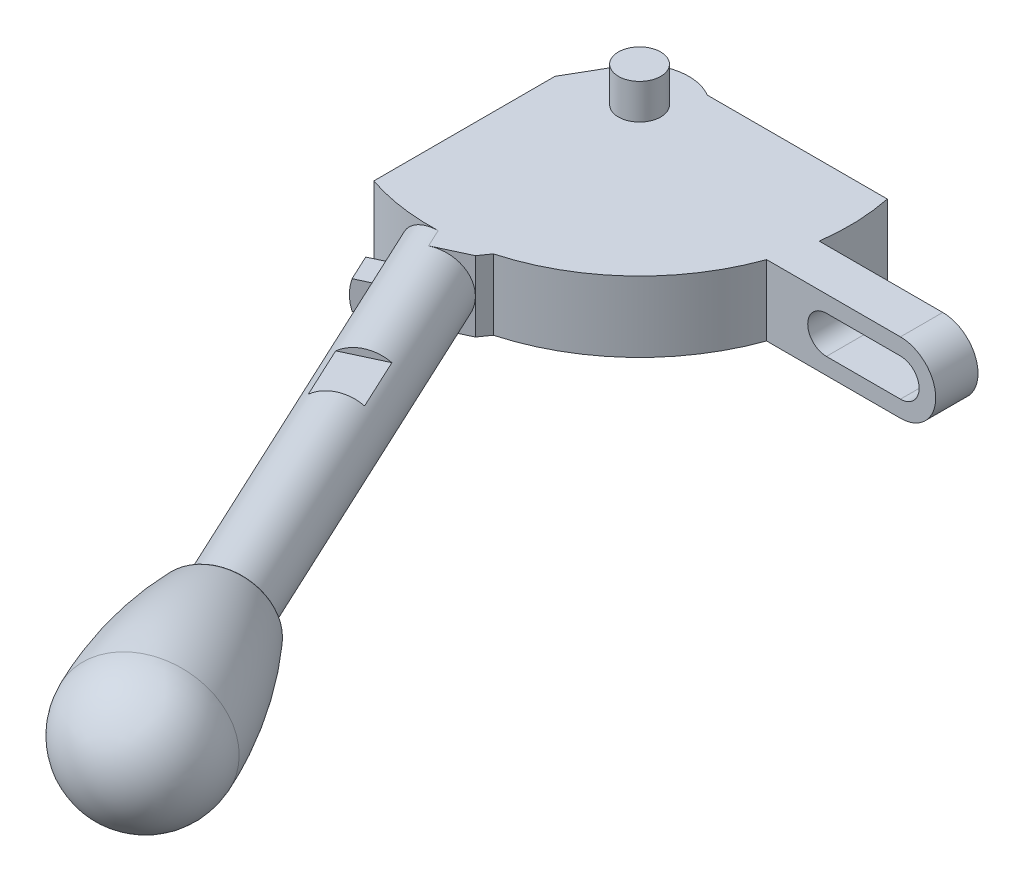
ISO-10303-21;
HEADER;
FILE_DESCRIPTION(('STEP AP214'),'2;1');
FILE_NAME('part.step','',(''),(''),'','','');
FILE_SCHEMA(('AUTOMOTIVE_DESIGN { 1 0 10303 214 1 1 1 1 }'));
ENDSEC;
DATA;
#1=APPLICATION_CONTEXT('core data for automotive mechanical design processes');
#2=APPLICATION_PROTOCOL_DEFINITION('international standard','automotive_design',2000,#1);
#3=PRODUCT_CONTEXT('',#1,'mechanical');
#4=PRODUCT('Part','Part','',(#3));
#5=PRODUCT_RELATED_PRODUCT_CATEGORY('part','',(#4));
#6=PRODUCT_DEFINITION_FORMATION('','',#4);
#7=PRODUCT_DEFINITION_CONTEXT('part definition',#1,'design');
#8=PRODUCT_DEFINITION('design','',#6,#7);
#9=PRODUCT_DEFINITION_SHAPE('','',#8);
#10=(LENGTH_UNIT() NAMED_UNIT(*) SI_UNIT(.MILLI.,.METRE.));
#11=(NAMED_UNIT(*) PLANE_ANGLE_UNIT() SI_UNIT($,.RADIAN.));
#12=(NAMED_UNIT(*) SI_UNIT($,.STERADIAN.) SOLID_ANGLE_UNIT());
#13=UNCERTAINTY_MEASURE_WITH_UNIT(LENGTH_MEASURE(1.E-05),#10,'distance_accuracy_value','');
#14=(GEOMETRIC_REPRESENTATION_CONTEXT(3) GLOBAL_UNCERTAINTY_ASSIGNED_CONTEXT((#13)) GLOBAL_UNIT_ASSIGNED_CONTEXT((#10,
#11,#12)) REPRESENTATION_CONTEXT('',''));
#15=CARTESIAN_POINT('',(0.,0.,0.));
#16=DIRECTION('',(0.,0.,1.));
#17=DIRECTION('',(1.,0.,0.));
#18=AXIS2_PLACEMENT_3D('',#15,#16,#17);
#19=CARTESIAN_POINT('',(37.4332550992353,0.,107.502842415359));
#20=DIRECTION('',(0.90630778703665,0.,-0.4226182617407));
#21=DIRECTION('',(0.4226182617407,0.,0.90630778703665));
#22=AXIS2_PLACEMENT_3D('',#19,#20,#21);
#23=SPHERICAL_SURFACE('',#22,10.);
#24=CARTESIAN_POINT('',(37.4332550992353,0.,107.502842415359));
#25=DIRECTION('',(-0.4226182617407,0.,-0.90630778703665));
#26=DIRECTION('',(0.90630778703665,0.,-0.4226182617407));
#27=AXIS2_PLACEMENT_3D('',#24,#25,#26);
#28=SPHERICAL_SURFACE('',#27,10.);
#29=CARTESIAN_POINT('',(37.4332550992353,0.,107.502842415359));
#30=DIRECTION('',(-0.4226182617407,0.,-0.90630778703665));
#31=DIRECTION('',(0.90630778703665,0.,-0.4226182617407));
#32=AXIS2_PLACEMENT_3D('',#29,#30,#31);
#33=CIRCLE('',#32,10.);
#34=CARTESIAN_POINT('',(46.4963329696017,0.,103.276659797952));
#35=VERTEX_POINT('',#34);
#36=EDGE_CURVE('E766',#35,#35,#33,.T.);
#37=ORIENTED_EDGE('',*,*,#36,.F.);
#38=EDGE_LOOP('',(#37));
#39=FACE_BOUND('',#38,.T.);
#40=ADVANCED_FACE('F14',(#39),#28,.T.);
#41=CARTESIAN_POINT('',(37.1311645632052,0.,106.855007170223));
#42=DIRECTION('',(-0.4226182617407,0.,-0.90630778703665));
#43=DIRECTION('',(0.90630778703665,0.,-0.4226182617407));
#44=AXIS2_PLACEMENT_3D('',#41,#42,#43);
#45=DEGENERATE_TOROIDAL_SURFACE('',#44,59.9963502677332,70.,.F.);
#46=CARTESIAN_POINT('',(28.7094254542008,0.,88.7945293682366));
#47=DIRECTION('',(-0.4226182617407,0.,-0.90630778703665));
#48=DIRECTION('',(0.90630778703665,0.,-0.4226182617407));
#49=AXIS2_PLACEMENT_3D('',#46,#47,#48);
#50=CIRCLE('',#49,7.10725210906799);
#51=CARTESIAN_POINT('',(35.1507833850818,0.,85.7908748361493));
#52=VERTEX_POINT('',#51);
#53=EDGE_CURVE('E772',#52,#52,#50,.T.);
#54=ORIENTED_EDGE('',*,*,#53,.F.);
#55=EDGE_LOOP('',(#54));
#56=FACE_BOUND('',#55,.T.);
#57=ORIENTED_EDGE('',*,*,#36,.T.);
#58=EDGE_LOOP('',(#57));
#59=FACE_BOUND('',#58,.T.);
#60=ADVANCED_FACE('F429',(#56,#59),#45,.F.);
#61=CARTESIAN_POINT('',(28.7695807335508,0.,88.923532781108));
#62=DIRECTION('',(-0.4226182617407,0.,-0.90630778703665));
#63=DIRECTION('',(0.90630778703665,0.,-0.4226182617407));
#64=AXIS2_PLACEMENT_3D('',#61,#62,#63);
#65=TOROIDAL_SURFACE('',#64,6.62794066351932,0.50000000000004);
#66=CARTESIAN_POINT('',(28.5582716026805,0.,88.4703788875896));
#67=DIRECTION('',(-0.4226182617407,0.,-0.90630778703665));
#68=DIRECTION('',(0.90630778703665,0.,-0.4226182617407));
#69=AXIS2_PLACEMENT_3D('',#66,#67,#68);
#70=CIRCLE('',#69,6.62794066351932);
#71=CARTESIAN_POINT('',(34.5652258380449,0.,85.6692901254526));
#72=VERTEX_POINT('',#71);
#73=EDGE_CURVE('E208',#72,#72,#70,.T.);
#74=ORIENTED_EDGE('',*,*,#73,.F.);
#75=EDGE_LOOP('',(#74));
#76=FACE_BOUND('',#75,.T.);
#77=ORIENTED_EDGE('',*,*,#53,.T.);
#78=EDGE_LOOP('',(#77));
#79=FACE_BOUND('',#78,.T.);
#80=ADVANCED_FACE('F425',(#76,#79),#65,.T.);
#81=CARTESIAN_POINT('',(28.5582716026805,-6.62794066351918,88.4703788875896));
#82=DIRECTION('',(0.4226182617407,0.,0.90630778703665));
#83=DIRECTION('',(-0.90630778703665,0.,0.4226182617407));
#84=AXIS2_PLACEMENT_3D('',#81,#82,#83);
#85=PLANE('',#84);
#86=ORIENTED_EDGE('',*,*,#73,.T.);
#87=EDGE_LOOP('',(#86));
#88=FACE_BOUND('',#87,.T.);
#89=CARTESIAN_POINT('',(28.5582716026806,0.,88.4703788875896));
#90=DIRECTION('',(-0.4226182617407,0.,-0.90630778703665));
#91=DIRECTION('',(-0.90630778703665,0.,0.4226182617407));
#92=AXIS2_PLACEMENT_3D('',#89,#90,#91);
#93=CIRCLE('',#92,5.);
#94=CARTESIAN_POINT('',(24.0267326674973,0.,90.5834701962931));
#95=VERTEX_POINT('',#94);
#96=EDGE_CURVE('E203',#95,#95,#93,.T.);
#97=ORIENTED_EDGE('',*,*,#96,.F.);
#98=EDGE_LOOP('',(#97));
#99=FACE_BOUND('',#98,.T.);
#100=ADVANCED_FACE('F421',(#88,#99),#85,.F.);
#101=CARTESIAN_POINT('',(14.9172252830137,7.,47.3860527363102));
#102=DIRECTION('',(-0.4226182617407,0.,-0.90630778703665));
#103=DIRECTION('',(-0.90630778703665,0.,0.4226182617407));
#104=AXIS2_PLACEMENT_3D('',#101,#102,#103);
#105=PLANE('',#104);
#106=DIRECTION('',(-0.90630778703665,0.,0.4226182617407));
#107=VECTOR('',#106,1.);
#108=CARTESIAN_POINT('',(14.9172252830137,4.,47.3860527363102));
#109=LINE('',#108,#107);
#110=CARTESIAN_POINT('',(13.1046097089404,4.,48.2312892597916));
#111=VERTEX_POINT('',#110);
#112=CARTESIAN_POINT('',(7.66676298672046,4.,50.7669988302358));
#113=VERTEX_POINT('',#112);
#114=EDGE_CURVE('E191',#111,#113,#109,.T.);
#115=ORIENTED_EDGE('',*,*,#114,.F.);
#116=CARTESIAN_POINT('',(10.3856863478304,0.,49.4991440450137));
#117=DIRECTION('',(-0.4226182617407,0.,-0.90630778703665));
#118=DIRECTION('',(-0.90630778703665,0.,0.4226182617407));
#119=AXIS2_PLACEMENT_3D('',#116,#117,#118);
#120=CIRCLE('',#119,5.);
#121=EDGE_CURVE('E196',#113,#111,#120,.T.);
#122=ORIENTED_EDGE('',*,*,#121,.F.);
#123=EDGE_LOOP('',(#115,#122));
#124=FACE_BOUND('',#123,.T.);
#125=ADVANCED_FACE('F424',(#124),#105,.F.);
#126=CARTESIAN_POINT('',(14.9172252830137,4.,47.3860527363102));
#127=DIRECTION('',(0.,-1.,0.));
#128=DIRECTION('',(0.4226182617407,0.,0.90630778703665));
#129=AXIS2_PLACEMENT_3D('',#126,#127,#128);
#130=PLANE('',#129);
#131=DIRECTION('',(-0.90630778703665,0.,0.4226182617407));
#132=VECTOR('',#131,1.);
#133=CARTESIAN_POINT('',(18.2981713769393,4.,54.6365150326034));
#134=LINE('',#133,#132);
#135=CARTESIAN_POINT('',(16.4855558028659,4.,55.4817515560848));
#136=VERTEX_POINT('',#135);
#137=CARTESIAN_POINT('',(11.0477090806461,4.,58.017461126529));
#138=VERTEX_POINT('',#137);
#139=EDGE_CURVE('E184',#136,#138,#134,.T.);
#140=ORIENTED_EDGE('',*,*,#139,.F.);
#141=DIRECTION('',(-0.4226182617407,0.,-0.90630778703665));
#142=VECTOR('',#141,1.);
#143=CARTESIAN_POINT('',(6.76533578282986,4.,34.6366724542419));
#144=LINE('',#143,#142);
#145=EDGE_CURVE('E176',#111,#136,#144,.F.);
#146=ORIENTED_EDGE('',*,*,#145,.F.);
#147=ORIENTED_EDGE('',*,*,#114,.T.);
#148=DIRECTION('',(-0.4226182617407,0.,-0.90630778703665));
#149=VECTOR('',#148,1.);
#150=CARTESIAN_POINT('',(1.32748906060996,4.,37.1723820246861));
#151=LINE('',#150,#149);
#152=EDGE_CURVE('E188',#138,#113,#151,.T.);
#153=ORIENTED_EDGE('',*,*,#152,.F.);
#154=EDGE_LOOP('',(#140,#146,#147,#153));
#155=FACE_BOUND('',#154,.T.);
#156=ADVANCED_FACE('F186',(#155),#130,.F.);
#157=CARTESIAN_POINT('',(18.2981713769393,7.,54.6365150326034));
#158=DIRECTION('',(0.4226182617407,0.,0.90630778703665));
#159=DIRECTION('',(0.90630778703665,0.,-0.4226182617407));
#160=AXIS2_PLACEMENT_3D('',#157,#158,#159);
#161=PLANE('',#160);
#162=ORIENTED_EDGE('',*,*,#139,.T.);
#163=CARTESIAN_POINT('',(13.766632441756,0.,56.7496063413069));
#164=DIRECTION('',(0.4226182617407,0.,0.90630778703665));
#165=DIRECTION('',(0.90630778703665,0.,-0.4226182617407));
#166=AXIS2_PLACEMENT_3D('',#163,#164,#165);
#167=CIRCLE('',#166,5.);
#168=EDGE_CURVE('E193',#136,#138,#167,.T.);
#169=ORIENTED_EDGE('',*,*,#168,.F.);
#170=EDGE_LOOP('',(#162,#169));
#171=FACE_BOUND('',#170,.T.);
#172=ADVANCED_FACE('F194',(#171),#161,.F.);
#173=CARTESIAN_POINT('',(4.0464124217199,0.,35.9045272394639));
#174=DIRECTION('',(0.4226182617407,0.,0.906307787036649));
#175=DIRECTION('',(0.906307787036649,0.,-0.4226182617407));
#176=AXIS2_PLACEMENT_3D('',#173,#174,#175);
#177=PLANE('',#176);
#178=DIRECTION('',(0.906307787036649,0.,-0.422618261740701));
#179=VECTOR('',#178,1.);
#180=CARTESIAN_POINT('',(-0.106811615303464,-2.,37.8412074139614));
#181=LINE('',#180,#179);
#182=CARTESIAN_POINT('',(-2.03328503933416,-2.,38.739536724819));
#183=VERTEX_POINT('',#182);
#184=CARTESIAN_POINT('',(-0.106811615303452,-2.,37.8412074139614));
#185=VERTEX_POINT('',#184);
#186=EDGE_CURVE('E252',#183,#185,#181,.T.);
#187=ORIENTED_EDGE('',*,*,#186,.T.);
#188=CARTESIAN_POINT('',(4.04641242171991,0.,35.904527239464));
#189=DIRECTION('',(-0.4226182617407,0.,-0.90630778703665));
#190=DIRECTION('',(-0.90630778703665,0.,0.4226182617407));
#191=AXIS2_PLACEMENT_3D('',#188,#189,#190);
#192=CIRCLE('',#191,5.);
#193=CARTESIAN_POINT('',(-0.106811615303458,2.,37.8412074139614));
#194=VERTEX_POINT('',#193);
#195=EDGE_CURVE('E34',#185,#194,#192,.T.);
#196=ORIENTED_EDGE('',*,*,#195,.T.);
#197=DIRECTION('',(-0.906307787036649,0.,0.422618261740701));
#198=VECTOR('',#197,1.);
#199=CARTESIAN_POINT('',(-0.106811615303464,2.,37.8412074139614));
#200=LINE('',#199,#198);
#201=CARTESIAN_POINT('',(-2.03328503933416,2.,38.739536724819));
#202=VERTEX_POINT('',#201);
#203=EDGE_CURVE('E268',#194,#202,#200,.T.);
#204=ORIENTED_EDGE('',*,*,#203,.T.);
#205=CARTESIAN_POINT('',(4.0464124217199,0.,35.9045272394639));
#206=DIRECTION('',(0.4226182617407,0.,0.906307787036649));
#207=DIRECTION('',(0.906307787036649,0.,-0.4226182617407));
#208=AXIS2_PLACEMENT_3D('',#205,#206,#207);
#209=CIRCLE('',#208,7.);
#210=EDGE_CURVE('E249',#202,#183,#209,.T.);
#211=ORIENTED_EDGE('',*,*,#210,.T.);
#212=EDGE_LOOP('',(#187,#196,#204,#211));
#213=FACE_BOUND('',#212,.T.);
#214=ADVANCED_FACE('F439',(#213),#177,.T.);
#215=CARTESIAN_POINT('',(4.0464124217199,0.,35.9045272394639));
#216=DIRECTION('',(-0.4226182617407,0.,-0.906307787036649));
#217=DIRECTION('',(-0.906307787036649,0.,0.4226182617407));
#218=AXIS2_PLACEMENT_3D('',#215,#216,#217);
#219=CYLINDRICAL_SURFACE('',#218,7.);
#220=CARTESIAN_POINT('',(2.3559393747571,0.,32.2792960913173));
#221=DIRECTION('',(0.4226182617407,0.,0.906307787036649));
#222=DIRECTION('',(0.906307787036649,0.,-0.4226182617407));
#223=AXIS2_PLACEMENT_3D('',#220,#221,#222);
#224=CIRCLE('',#223,7.);
#225=CARTESIAN_POINT('',(-3.72375808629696,2.,35.1143055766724));
#226=VERTEX_POINT('',#225);
#227=CARTESIAN_POINT('',(-3.72375808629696,-2.,35.1143055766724));
#228=VERTEX_POINT('',#227);
#229=EDGE_CURVE('E248',#226,#228,#224,.T.);
#230=ORIENTED_EDGE('',*,*,#229,.T.);
#231=DIRECTION('',(-0.4226182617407,0.,-0.906307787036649));
#232=VECTOR('',#231,1.);
#233=CARTESIAN_POINT('',(-2.03328503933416,-2.,38.739536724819));
#234=LINE('',#233,#232);
#235=EDGE_CURVE('E269',#183,#228,#234,.T.);
#236=ORIENTED_EDGE('',*,*,#235,.F.);
#237=ORIENTED_EDGE('',*,*,#210,.F.);
#238=DIRECTION('',(-0.4226182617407,0.,-0.906307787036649));
#239=VECTOR('',#238,1.);
#240=CARTESIAN_POINT('',(-2.03328503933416,2.,38.739536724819));
#241=LINE('',#240,#239);
#242=EDGE_CURVE('E264',#202,#226,#241,.T.);
#243=ORIENTED_EDGE('',*,*,#242,.T.);
#244=EDGE_LOOP('',(#230,#236,#237,#243));
#245=FACE_BOUND('',#244,.T.);
#246=ADVANCED_FACE('F466',(#245),#219,.T.);
#247=CARTESIAN_POINT('',(-0.106811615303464,-2.,37.8412074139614));
#248=DIRECTION('',(0.,1.,0.));
#249=DIRECTION('',(1.,0.,0.));
#250=AXIS2_PLACEMENT_3D('',#247,#248,#249);
#251=PLANE('',#250);
#252=DIRECTION('',(0.906307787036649,0.,-0.422618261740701));
#253=VECTOR('',#252,1.);
#254=CARTESIAN_POINT('',(-1.79728466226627,-2.,34.2159762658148));
#255=LINE('',#254,#253);
#256=CARTESIAN_POINT('',(-1.79728466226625,-2.,34.2159762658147));
#257=VERTEX_POINT('',#256);
#258=EDGE_CURVE('E256',#228,#257,#255,.T.);
#259=ORIENTED_EDGE('',*,*,#258,.T.);
#260=DIRECTION('',(-0.4226182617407,0.,-0.906307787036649));
#261=VECTOR('',#260,1.);
#262=CARTESIAN_POINT('',(-0.106811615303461,-2.,37.8412074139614));
#263=LINE('',#262,#261);
#264=EDGE_CURVE('E273',#185,#257,#263,.T.);
#265=ORIENTED_EDGE('',*,*,#264,.F.);
#266=ORIENTED_EDGE('',*,*,#186,.F.);
#267=ORIENTED_EDGE('',*,*,#235,.T.);
#268=EDGE_LOOP('',(#259,#265,#266,#267));
#269=FACE_BOUND('',#268,.T.);
#270=ADVANCED_FACE('F474',(#269),#251,.F.);
#271=CARTESIAN_POINT('',(-0.106811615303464,2.,37.8412074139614));
#272=DIRECTION('',(0.,-1.,0.));
#273=DIRECTION('',(-1.,0.,0.));
#274=AXIS2_PLACEMENT_3D('',#271,#272,#273);
#275=PLANE('',#274);
#276=DIRECTION('',(-0.906307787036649,0.,0.422618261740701));
#277=VECTOR('',#276,1.);
#278=CARTESIAN_POINT('',(-1.79728466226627,2.,34.2159762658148));
#279=LINE('',#278,#277);
#280=CARTESIAN_POINT('',(-1.79728466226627,2.,34.2159762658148));
#281=VERTEX_POINT('',#280);
#282=EDGE_CURVE('E253',#281,#226,#279,.T.);
#283=ORIENTED_EDGE('',*,*,#282,.T.);
#284=ORIENTED_EDGE('',*,*,#242,.F.);
#285=ORIENTED_EDGE('',*,*,#203,.F.);
#286=DIRECTION('',(-0.4226182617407,0.,-0.906307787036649));
#287=VECTOR('',#286,1.);
#288=CARTESIAN_POINT('',(-0.106811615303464,2.,37.8412074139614));
#289=LINE('',#288,#287);
#290=EDGE_CURVE('E267',#194,#281,#289,.T.);
#291=ORIENTED_EDGE('',*,*,#290,.T.);
#292=EDGE_LOOP('',(#283,#284,#285,#291));
#293=FACE_BOUND('',#292,.T.);
#294=ADVANCED_FACE('F470',(#293),#275,.F.);
#295=CARTESIAN_POINT('',(2.3559393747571,0.,32.2792960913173));
#296=DIRECTION('',(0.4226182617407,0.,0.906307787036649));
#297=DIRECTION('',(0.906307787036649,0.,-0.4226182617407));
#298=AXIS2_PLACEMENT_3D('',#295,#296,#297);
#299=PLANE('',#298);
#300=ORIENTED_EDGE('',*,*,#282,.F.);
#301=CARTESIAN_POINT('',(2.35593937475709,0.,32.2792960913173));
#302=DIRECTION('',(-0.4226182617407,0.,-0.906307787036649));
#303=DIRECTION('',(-0.906307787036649,0.,0.4226182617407));
#304=AXIS2_PLACEMENT_3D('',#301,#302,#303);
#305=CIRCLE('',#304,5.);
#306=EDGE_CURVE('E362',#281,#257,#305,.F.);
#307=ORIENTED_EDGE('',*,*,#306,.T.);
#308=ORIENTED_EDGE('',*,*,#258,.F.);
#309=ORIENTED_EDGE('',*,*,#229,.F.);
#310=EDGE_LOOP('',(#300,#307,#308,#309));
#311=FACE_BOUND('',#310,.T.);
#312=ADVANCED_FACE('F456',(#311),#299,.F.);
#313=CARTESIAN_POINT('',(36.5,0.,12.));
#314=DIRECTION('',(0.,0.,-1.));
#315=DIRECTION('',(0.,1.,0.));
#316=AXIS2_PLACEMENT_3D('',#313,#314,#315);
#317=CYLINDRICAL_SURFACE('',#316,2.65);
#318=DIRECTION('',(0.,0.,-1.));
#319=VECTOR('',#318,1.);
#320=CARTESIAN_POINT('',(36.5,-2.65,12.));
#321=LINE('',#320,#319);
#322=CARTESIAN_POINT('',(36.5,-2.65,10.));
#323=VERTEX_POINT('',#322);
#324=CARTESIAN_POINT('',(36.5,-2.65,4.));
#325=VERTEX_POINT('',#324);
#326=EDGE_CURVE('E167',#323,#325,#321,.T.);
#327=ORIENTED_EDGE('',*,*,#326,.T.);
#328=CARTESIAN_POINT('',(36.5,0.,4.));
#329=DIRECTION('',(0.,0.,-1.));
#330=DIRECTION('',(0.,1.,0.));
#331=AXIS2_PLACEMENT_3D('',#328,#329,#330);
#332=CIRCLE('',#331,2.65);
#333=CARTESIAN_POINT('',(36.5,2.65,4.));
#334=VERTEX_POINT('',#333);
#335=EDGE_CURVE('E223',#325,#334,#332,.T.);
#336=ORIENTED_EDGE('',*,*,#335,.T.);
#337=DIRECTION('',(0.,0.,-1.));
#338=VECTOR('',#337,1.);
#339=CARTESIAN_POINT('',(36.5,2.65,12.));
#340=LINE('',#339,#338);
#341=CARTESIAN_POINT('',(36.5,2.65,10.));
#342=VERTEX_POINT('',#341);
#343=EDGE_CURVE('E233',#342,#334,#340,.T.);
#344=ORIENTED_EDGE('',*,*,#343,.F.);
#345=CARTESIAN_POINT('',(36.5,0.,10.));
#346=DIRECTION('',(0.,0.,-1.));
#347=DIRECTION('',(0.,1.,0.));
#348=AXIS2_PLACEMENT_3D('',#345,#346,#347);
#349=CIRCLE('',#348,2.65);
#350=EDGE_CURVE('E239',#323,#342,#349,.T.);
#351=ORIENTED_EDGE('',*,*,#350,.F.);
#352=EDGE_LOOP('',(#327,#336,#344,#351));
#353=FACE_BOUND('',#352,.T.);
#354=ADVANCED_FACE('F452',(#353),#317,.F.);
#355=CARTESIAN_POINT('',(47.,2.65,12.));
#356=DIRECTION('',(0.,1.,0.));
#357=DIRECTION('',(1.,0.,0.));
#358=AXIS2_PLACEMENT_3D('',#355,#356,#357);
#359=PLANE('',#358);
#360=ORIENTED_EDGE('',*,*,#343,.T.);
#361=DIRECTION('',(1.,0.,0.));
#362=VECTOR('',#361,1.);
#363=CARTESIAN_POINT('',(47.,2.65,4.));
#364=LINE('',#363,#362);
#365=CARTESIAN_POINT('',(47.,2.65,4.));
#366=VERTEX_POINT('',#365);
#367=EDGE_CURVE('E226',#334,#366,#364,.T.);
#368=ORIENTED_EDGE('',*,*,#367,.T.);
#369=DIRECTION('',(0.,0.,-1.));
#370=VECTOR('',#369,1.);
#371=CARTESIAN_POINT('',(47.,2.65,12.));
#372=LINE('',#371,#370);
#373=CARTESIAN_POINT('',(47.,2.65,10.));
#374=VERTEX_POINT('',#373);
#375=EDGE_CURVE('E230',#374,#366,#372,.T.);
#376=ORIENTED_EDGE('',*,*,#375,.F.);
#377=DIRECTION('',(1.,0.,0.));
#378=VECTOR('',#377,1.);
#379=CARTESIAN_POINT('',(52.,2.65,10.));
#380=LINE('',#379,#378);
#381=EDGE_CURVE('E242',#342,#374,#380,.T.);
#382=ORIENTED_EDGE('',*,*,#381,.F.);
#383=EDGE_LOOP('',(#360,#368,#376,#382));
#384=FACE_BOUND('',#383,.T.);
#385=ADVANCED_FACE('F448',(#384),#359,.F.);
#386=CARTESIAN_POINT('',(47.,0.,12.));
#387=DIRECTION('',(0.,0.,-1.));
#388=DIRECTION('',(0.,1.,0.));
#389=AXIS2_PLACEMENT_3D('',#386,#387,#388);
#390=CYLINDRICAL_SURFACE('',#389,2.65);
#391=ORIENTED_EDGE('',*,*,#375,.T.);
#392=CARTESIAN_POINT('',(47.,0.,4.));
#393=DIRECTION('',(0.,0.,-1.));
#394=DIRECTION('',(0.,1.,0.));
#395=AXIS2_PLACEMENT_3D('',#392,#393,#394);
#396=CIRCLE('',#395,2.65);
#397=CARTESIAN_POINT('',(47.,-2.65,4.));
#398=VERTEX_POINT('',#397);
#399=EDGE_CURVE('E161',#366,#398,#396,.T.);
#400=ORIENTED_EDGE('',*,*,#399,.T.);
#401=DIRECTION('',(0.,0.,-1.));
#402=VECTOR('',#401,1.);
#403=CARTESIAN_POINT('',(47.,-2.65,12.));
#404=LINE('',#403,#402);
#405=CARTESIAN_POINT('',(47.,-2.65,10.));
#406=VERTEX_POINT('',#405);
#407=EDGE_CURVE('E229',#406,#398,#404,.T.);
#408=ORIENTED_EDGE('',*,*,#407,.F.);
#409=CARTESIAN_POINT('',(47.,0.,10.));
#410=DIRECTION('',(0.,0.,-1.));
#411=DIRECTION('',(0.,1.,0.));
#412=AXIS2_PLACEMENT_3D('',#409,#410,#411);
#413=CIRCLE('',#412,2.65);
#414=EDGE_CURVE('E245',#374,#406,#413,.T.);
#415=ORIENTED_EDGE('',*,*,#414,.F.);
#416=EDGE_LOOP('',(#391,#400,#408,#415));
#417=FACE_BOUND('',#416,.T.);
#418=ADVANCED_FACE('F451',(#417),#390,.F.);
#419=CARTESIAN_POINT('',(47.,-2.65,12.));
#420=DIRECTION('',(0.,-1.,0.));
#421=DIRECTION('',(-1.,0.,0.));
#422=AXIS2_PLACEMENT_3D('',#419,#420,#421);
#423=PLANE('',#422);
#424=ORIENTED_EDGE('',*,*,#407,.T.);
#425=DIRECTION('',(-1.,0.,0.));
#426=VECTOR('',#425,1.);
#427=CARTESIAN_POINT('',(47.,-2.65,4.));
#428=LINE('',#427,#426);
#429=EDGE_CURVE('E221',#398,#325,#428,.T.);
#430=ORIENTED_EDGE('',*,*,#429,.T.);
#431=ORIENTED_EDGE('',*,*,#326,.F.);
#432=DIRECTION('',(-1.,0.,0.));
#433=VECTOR('',#432,1.);
#434=CARTESIAN_POINT('',(52.,-2.65,10.));
#435=LINE('',#434,#433);
#436=EDGE_CURVE('E232',#406,#323,#435,.T.);
#437=ORIENTED_EDGE('',*,*,#436,.F.);
#438=EDGE_LOOP('',(#424,#430,#431,#437));
#439=FACE_BOUND('',#438,.T.);
#440=ADVANCED_FACE('F458',(#439),#423,.F.);
#441=CARTESIAN_POINT('',(-2.17559956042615,-5.,34.3923874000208));
#442=DIRECTION('',(-0.4226182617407,0.,-0.906307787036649));
#443=DIRECTION('',(-0.906307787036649,0.,0.4226182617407));
#444=AXIS2_PLACEMENT_3D('',#441,#442,#443);
#445=PLANE('',#444);
#446=CARTESIAN_POINT('',(2.3559393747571,0.,32.2792960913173));
#447=DIRECTION('',(0.4226182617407,0.,0.906307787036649));
#448=DIRECTION('',(0.906307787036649,0.,-0.4226182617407));
#449=AXIS2_PLACEMENT_3D('',#446,#447,#448);
#450=CIRCLE('',#449,5.);
#451=CARTESIAN_POINT('',(6.88747830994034,0.,30.1662047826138));
#452=VERTEX_POINT('',#451);
#453=CARTESIAN_POINT('',(2.35593937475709,5.,32.2792960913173));
#454=VERTEX_POINT('',#453);
#455=EDGE_CURVE('E259',#452,#454,#450,.T.);
#456=ORIENTED_EDGE('',*,*,#455,.F.);
#457=DIRECTION('',(0.,1.,0.));
#458=VECTOR('',#457,1.);
#459=CARTESIAN_POINT('',(6.88747830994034,-5.,30.1662047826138));
#460=LINE('',#459,#458);
#461=CARTESIAN_POINT('',(6.88747830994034,5.,30.1662047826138));
#462=VERTEX_POINT('',#461);
#463=EDGE_CURVE('E346',#452,#462,#460,.T.);
#464=ORIENTED_EDGE('',*,*,#463,.T.);
#465=DIRECTION('',(-0.906307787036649,0.,0.4226182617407));
#466=VECTOR('',#465,1.);
#467=CARTESIAN_POINT('',(-2.17559956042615,5.,34.3923874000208));
#468=LINE('',#467,#466);
#469=EDGE_CURVE('E319',#462,#454,#468,.T.);
#470=ORIENTED_EDGE('',*,*,#469,.T.);
#471=EDGE_LOOP('',(#456,#464,#470));
#472=FACE_BOUND('',#471,.T.);
#473=ADVANCED_FACE('F461',(#472),#445,.F.);
#474=CARTESIAN_POINT('',(0.,-5.,0.));
#475=DIRECTION('',(0.,1.,0.));
#476=DIRECTION('',(0.,0.,1.));
#477=AXIS2_PLACEMENT_3D('',#474,#475,#476);
#478=CYLINDRICAL_SURFACE('',#477,29.75);
#479=CARTESIAN_POINT('',(0.,5.,0.));
#480=DIRECTION('',(0.,-1.,0.));
#481=DIRECTION('',(0.,0.,1.));
#482=AXIS2_PLACEMENT_3D('',#479,#480,#481);
#483=CIRCLE('',#482,29.75);
#484=CARTESIAN_POINT('',(29.138677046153,5.,-6.));
#485=VERTEX_POINT('',#484);
#486=CARTESIAN_POINT('',(29.4798660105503,5.,4.));
#487=VERTEX_POINT('',#486);
#488=EDGE_CURVE('E298',#485,#487,#483,.T.);
#489=ORIENTED_EDGE('',*,*,#488,.T.);
#490=DIRECTION('',(0.,1.,0.));
#491=VECTOR('',#490,1.);
#492=CARTESIAN_POINT('',(29.4798660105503,-5.,4.));
#493=LINE('',#492,#491);
#494=CARTESIAN_POINT('',(29.4798660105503,-5.,4.));
#495=VERTEX_POINT('',#494);
#496=EDGE_CURVE('E303',#495,#487,#493,.T.);
#497=ORIENTED_EDGE('',*,*,#496,.F.);
#498=CARTESIAN_POINT('',(0.,-5.,0.));
#499=DIRECTION('',(0.,-1.,0.));
#500=DIRECTION('',(0.,0.,1.));
#501=AXIS2_PLACEMENT_3D('',#498,#499,#500);
#502=CIRCLE('',#501,29.75);
#503=CARTESIAN_POINT('',(29.138677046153,-5.,-6.));
#504=VERTEX_POINT('',#503);
#505=EDGE_CURVE('E284',#504,#495,#502,.T.);
#506=ORIENTED_EDGE('',*,*,#505,.F.);
#507=DIRECTION('',(0.,1.,0.));
#508=VECTOR('',#507,1.);
#509=CARTESIAN_POINT('',(29.138677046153,-5.,-6.));
#510=LINE('',#509,#508);
#511=EDGE_CURVE('E306',#504,#485,#510,.T.);
#512=ORIENTED_EDGE('',*,*,#511,.T.);
#513=EDGE_LOOP('',(#489,#497,#506,#512));
#514=FACE_BOUND('',#513,.T.);
#515=ADVANCED_FACE('F482',(#514),#478,.T.);
#516=CARTESIAN_POINT('',(29.138677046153,-5.,-6.));
#517=DIRECTION('',(0.,0.,1.));
#518=DIRECTION('',(1.,0.,0.));
#519=AXIS2_PLACEMENT_3D('',#516,#517,#518);
#520=PLANE('',#519);
#521=DIRECTION('',(1.,0.,0.));
#522=VECTOR('',#521,1.);
#523=CARTESIAN_POINT('',(29.138677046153,5.,-6.));
#524=LINE('',#523,#522);
#525=CARTESIAN_POINT('',(3.605551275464,5.,-6.));
#526=VERTEX_POINT('',#525);
#527=EDGE_CURVE('E295',#526,#485,#524,.T.);
#528=ORIENTED_EDGE('',*,*,#527,.T.);
#529=ORIENTED_EDGE('',*,*,#511,.F.);
#530=DIRECTION('',(1.,0.,0.));
#531=VECTOR('',#530,1.);
#532=CARTESIAN_POINT('',(29.138677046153,-5.,-6.));
#533=LINE('',#532,#531);
#534=CARTESIAN_POINT('',(3.605551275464,-5.,-6.));
#535=VERTEX_POINT('',#534);
#536=EDGE_CURVE('E281',#535,#504,#533,.T.);
#537=ORIENTED_EDGE('',*,*,#536,.F.);
#538=DIRECTION('',(0.,1.,0.));
#539=VECTOR('',#538,1.);
#540=CARTESIAN_POINT('',(3.605551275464,-5.,-6.));
#541=LINE('',#540,#539);
#542=EDGE_CURVE('E308',#535,#526,#541,.T.);
#543=ORIENTED_EDGE('',*,*,#542,.T.);
#544=EDGE_LOOP('',(#528,#529,#537,#543));
#545=FACE_BOUND('',#544,.T.);
#546=ADVANCED_FACE('F485',(#545),#520,.F.);
#547=CARTESIAN_POINT('',(0.,-5.,0.));
#548=DIRECTION('',(0.,1.,0.));
#549=DIRECTION('',(0.,0.,1.));
#550=AXIS2_PLACEMENT_3D('',#547,#548,#549);
#551=CYLINDRICAL_SURFACE('',#550,7.);
#552=CARTESIAN_POINT('',(0.,5.,0.));
#553=DIRECTION('',(0.,-1.,0.));
#554=DIRECTION('',(0.,0.,1.));
#555=AXIS2_PLACEMENT_3D('',#552,#553,#554);
#556=CIRCLE('',#555,7.);
#557=CARTESIAN_POINT('',(-6.32447149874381,5.,-3.00017670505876));
#558=VERTEX_POINT('',#557);
#559=EDGE_CURVE('E293',#558,#526,#556,.T.);
#560=ORIENTED_EDGE('',*,*,#559,.T.);
#561=ORIENTED_EDGE('',*,*,#542,.F.);
#562=CARTESIAN_POINT('',(0.,-5.,0.));
#563=DIRECTION('',(0.,-1.,0.));
#564=DIRECTION('',(0.,0.,1.));
#565=AXIS2_PLACEMENT_3D('',#562,#563,#564);
#566=CIRCLE('',#565,7.);
#567=CARTESIAN_POINT('',(-6.32447149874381,-5.,-3.00017670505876));
#568=VERTEX_POINT('',#567);
#569=EDGE_CURVE('E277',#568,#535,#566,.T.);
#570=ORIENTED_EDGE('',*,*,#569,.F.);
#571=DIRECTION('',(0.,1.,0.));
#572=VECTOR('',#571,1.);
#573=CARTESIAN_POINT('',(-6.32447149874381,-5.,-3.00017670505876));
#574=LINE('',#573,#572);
#575=EDGE_CURVE('E311',#568,#558,#574,.T.);
#576=ORIENTED_EDGE('',*,*,#575,.T.);
#577=EDGE_LOOP('',(#560,#561,#570,#576));
#578=FACE_BOUND('',#577,.T.);
#579=ADVANCED_FACE('F489',(#578),#551,.T.);
#580=CARTESIAN_POINT('',(-9.5,-5.,2.5));
#581=DIRECTION('',(0.866025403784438,0.,0.5));
#582=DIRECTION('',(0.5,0.,-0.866025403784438));
#583=AXIS2_PLACEMENT_3D('',#580,#581,#582);
#584=PLANE('',#583);
#585=DIRECTION('',(0.5,0.,-0.866025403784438));
#586=VECTOR('',#585,1.);
#587=CARTESIAN_POINT('',(-9.5,5.,2.5));
#588=LINE('',#587,#586);
#589=CARTESIAN_POINT('',(-9.5,5.,2.5));
#590=VERTEX_POINT('',#589);
#591=EDGE_CURVE('E272',#590,#558,#588,.T.);
#592=ORIENTED_EDGE('',*,*,#591,.T.);
#593=ORIENTED_EDGE('',*,*,#575,.F.);
#594=DIRECTION('',(0.5,0.,-0.866025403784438));
#595=VECTOR('',#594,1.);
#596=CARTESIAN_POINT('',(-9.5,-5.,2.5));
#597=LINE('',#596,#595);
#598=CARTESIAN_POINT('',(-9.5,-5.,2.5));
#599=VERTEX_POINT('',#598);
#600=EDGE_CURVE('E274',#599,#568,#597,.T.);
#601=ORIENTED_EDGE('',*,*,#600,.F.);
#602=DIRECTION('',(0.,1.,0.));
#603=VECTOR('',#602,1.);
#604=CARTESIAN_POINT('',(-9.5,-5.,2.5));
#605=LINE('',#604,#603);
#606=EDGE_CURVE('E290',#599,#590,#605,.T.);
#607=ORIENTED_EDGE('',*,*,#606,.T.);
#608=EDGE_LOOP('',(#592,#593,#601,#607));
#609=FACE_BOUND('',#608,.T.);
#610=ADVANCED_FACE('F393',(#609),#584,.F.);
#611=CARTESIAN_POINT('',(-9.5,-5.,36.));
#612=DIRECTION('',(-1.,0.,0.));
#613=DIRECTION('',(0.,1.,0.));
#614=AXIS2_PLACEMENT_3D('',#611,#612,#613);
#615=PLANE('',#614);
#616=ORIENTED_EDGE('',*,*,#606,.F.);
#617=DIRECTION('',(0.,0.,-1.));
#618=VECTOR('',#617,1.);
#619=CARTESIAN_POINT('',(-9.5,-5.,36.));
#620=LINE('',#619,#618);
#621=CARTESIAN_POINT('',(-9.5,-5.,28.1924191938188));
#622=VERTEX_POINT('',#621);
#623=EDGE_CURVE('E345',#622,#599,#620,.T.);
#624=ORIENTED_EDGE('',*,*,#623,.F.);
#625=DIRECTION('',(0.,1.,0.));
#626=VECTOR('',#625,1.);
#627=CARTESIAN_POINT('',(-9.5,-5.,28.1924191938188));
#628=LINE('',#627,#626);
#629=CARTESIAN_POINT('',(-9.5,5.,28.1924191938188));
#630=VERTEX_POINT('',#629);
#631=EDGE_CURVE('E330',#622,#630,#628,.T.);
#632=ORIENTED_EDGE('',*,*,#631,.T.);
#633=DIRECTION('',(0.,0.,-1.));
#634=VECTOR('',#633,1.);
#635=CARTESIAN_POINT('',(-9.5,5.,36.));
#636=LINE('',#635,#634);
#637=EDGE_CURVE('E354',#630,#590,#636,.T.);
#638=ORIENTED_EDGE('',*,*,#637,.T.);
#639=EDGE_LOOP('',(#616,#624,#632,#638));
#640=FACE_BOUND('',#639,.T.);
#641=ADVANCED_FACE('F381',(#640),#615,.T.);
#642=CARTESIAN_POINT('',(0.,-5.,0.));
#643=DIRECTION('',(0.,1.,0.));
#644=DIRECTION('',(0.,0.,1.));
#645=AXIS2_PLACEMENT_3D('',#642,#643,#644);
#646=CYLINDRICAL_SURFACE('',#645,29.75);
#647=CARTESIAN_POINT('',(0.,5.,0.));
#648=DIRECTION('',(0.,-1.,0.));
#649=DIRECTION('',(0.,0.,1.));
#650=AXIS2_PLACEMENT_3D('',#647,#648,#649);
#651=CIRCLE('',#650,29.75);
#652=CARTESIAN_POINT('',(1.16585285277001,5.,29.7271473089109));
#653=VERTEX_POINT('',#652);
#654=EDGE_CURVE('E305',#653,#630,#651,.T.);
#655=ORIENTED_EDGE('',*,*,#654,.T.);
#656=ORIENTED_EDGE('',*,*,#631,.F.);
#657=CARTESIAN_POINT('',(0.,-5.,0.));
#658=DIRECTION('',(0.,-1.,0.));
#659=DIRECTION('',(0.,0.,1.));
#660=AXIS2_PLACEMENT_3D('',#657,#658,#659);
#661=CIRCLE('',#660,29.75);
#662=CARTESIAN_POINT('',(1.16585285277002,-5.,29.7271473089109));
#663=VERTEX_POINT('',#662);
#664=EDGE_CURVE('E315',#663,#622,#661,.T.);
#665=ORIENTED_EDGE('',*,*,#664,.F.);
#666=CARTESIAN_POINT('',(1.16585285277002,-5.,29.7271473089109));
#667=CARTESIAN_POINT('',(0.99754210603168,-5.00000668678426,29.7337622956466));
#668=CARTESIAN_POINT('',(0.829201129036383,-4.99276214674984,29.7389191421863));
#669=CARTESIAN_POINT('',(0.49370668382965,-4.96414319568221,29.746372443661));
#670=CARTESIAN_POINT('',(0.326552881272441,-4.94277293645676,29.7486697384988));
#671=CARTESIAN_POINT('',(-0.00530531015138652,-4.88629414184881,29.7504630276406));
#672=CARTESIAN_POINT('',(-0.170011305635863,-4.85119507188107,29.749960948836));
#673=CARTESIAN_POINT('',(-0.495981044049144,-4.76764500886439,29.7463116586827));
#674=CARTESIAN_POINT('',(-0.657244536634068,-4.71919304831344,29.7431642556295));
#675=CARTESIAN_POINT('',(-0.975095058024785,-4.60936630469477,29.7344404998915));
#676=CARTESIAN_POINT('',(-1.13168573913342,-4.54800193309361,29.7288661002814));
#677=CARTESIAN_POINT('',(-1.43924171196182,-4.41269900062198,29.7155645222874));
#678=CARTESIAN_POINT('',(-1.59020707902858,-4.33876060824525,29.7078373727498));
#679=CARTESIAN_POINT('',(-1.88552447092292,-4.17860580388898,29.690557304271));
#680=CARTESIAN_POINT('',(-2.02987136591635,-4.09238007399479,29.6810029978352));
#681=CARTESIAN_POINT('',(-2.31067877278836,-3.90804429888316,29.6604633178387));
#682=CARTESIAN_POINT('',(-2.44713891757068,-3.80993370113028,29.6494778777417));
#683=CARTESIAN_POINT('',(-2.7118739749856,-3.60146021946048,29.6264412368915));
#684=CARTESIAN_POINT('',(-2.84008327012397,-3.49101462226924,29.6143829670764));
#685=CARTESIAN_POINT('',(-3.08580704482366,-3.25894237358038,29.5897876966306));
#686=CARTESIAN_POINT('',(-3.20332672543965,-3.13732121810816,29.5772509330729));
#687=CARTESIAN_POINT('',(-3.42613773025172,-2.88352495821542,29.5522696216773));
#688=CARTESIAN_POINT('',(-3.53144060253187,-2.75136002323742,29.539824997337));
#689=CARTESIAN_POINT('',(-3.72831077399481,-2.47713087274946,29.5156236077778));
#690=CARTESIAN_POINT('',(-3.81988352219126,-2.33507061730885,29.5038665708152));
#691=CARTESIAN_POINT('',(-3.96579915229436,-2.08019722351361,29.4845528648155));
#692=CARTESIAN_POINT('',(-4.02362950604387,-1.96939158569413,29.4766992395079));
#693=CARTESIAN_POINT('',(-4.13019325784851,-1.74343772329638,29.4619567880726));
#694=CARTESIAN_POINT('',(-4.17892872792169,-1.62829049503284,29.4550677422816));
#695=CARTESIAN_POINT('',(-4.26658310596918,-1.39450670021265,29.4424986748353));
#696=CARTESIAN_POINT('',(-4.30552122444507,-1.27587747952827,29.4368162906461));
#697=CARTESIAN_POINT('',(-4.37312965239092,-1.03570812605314,29.4268483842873));
#698=CARTESIAN_POINT('',(-4.40180348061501,-0.914169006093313,29.4225623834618));
#699=CARTESIAN_POINT('',(-4.4499207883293,-0.661259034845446,29.4153249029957));
#700=CARTESIAN_POINT('',(-4.46866758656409,-0.529751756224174,29.4124747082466));
#701=CARTESIAN_POINT('',(-4.49370839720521,-0.265494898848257,29.4086593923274));
#702=CARTESIAN_POINT('',(-4.49999957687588,-0.132745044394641,29.4076946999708));
#703=CARTESIAN_POINT('',(-4.5000003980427,0.124876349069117,29.4076944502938));
#704=CARTESIAN_POINT('',(-4.49443372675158,0.249748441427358,29.4085479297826));
#705=CARTESIAN_POINT('',(-4.4722605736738,0.49853131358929,29.4119280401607));
#706=CARTESIAN_POINT('',(-4.45565000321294,0.622441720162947,29.4144552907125));
#707=CARTESIAN_POINT('',(-4.41163919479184,0.868428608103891,29.4210882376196));
#708=CARTESIAN_POINT('',(-4.38422662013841,0.990502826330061,29.4251957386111));
#709=CARTESIAN_POINT('',(-4.31903831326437,1.23184013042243,29.4348346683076));
#710=CARTESIAN_POINT('',(-4.28125820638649,1.35110200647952,29.4403666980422));
#711=CARTESIAN_POINT('',(-4.19612142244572,1.58536647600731,29.4526212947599));
#712=CARTESIAN_POINT('',(-4.14881698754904,1.7003884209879,29.4593373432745));
#713=CARTESIAN_POINT('',(-4.04513140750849,1.92621964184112,29.4737536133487));
#714=CARTESIAN_POINT('',(-3.98874677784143,2.03702728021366,29.4814542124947));
#715=CARTESIAN_POINT('',(-3.80700732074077,2.36218799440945,29.5056624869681));
#716=CARTESIAN_POINT('',(-3.66898282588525,2.56950572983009,29.5232893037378));
#717=CARTESIAN_POINT('',(-3.35288014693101,2.97707215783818,29.5609181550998));
#718=CARTESIAN_POINT('',(-3.1725278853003,3.17553005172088,29.5809984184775));
#719=CARTESIAN_POINT('',(-2.78500339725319,3.54442634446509,29.6199966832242));
#720=CARTESIAN_POINT('',(-2.57781645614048,3.71484925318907,29.6389140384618));
#721=CARTESIAN_POINT('',(-2.10791980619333,4.05023526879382,29.676303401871));
#722=CARTESIAN_POINT('',(-1.84159218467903,4.21018938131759,29.69424449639));
#723=CARTESIAN_POINT('',(-1.2873543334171,4.48808885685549,29.7234270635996));
#724=CARTESIAN_POINT('',(-0.999437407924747,4.60602112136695,29.7346664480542));
#725=CARTESIAN_POINT('',(-0.553702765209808,4.75058288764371,29.7452316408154));
#726=CARTESIAN_POINT('',(-0.401104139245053,4.79366084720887,29.7476955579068));
#727=CARTESIAN_POINT('',(-0.0929891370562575,4.86792381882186,29.7502529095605));
#728=CARTESIAN_POINT('',(0.0625271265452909,4.89910928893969,29.7503464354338));
#729=CARTESIAN_POINT('',(0.375524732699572,4.94925271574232,29.7480410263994));
#730=CARTESIAN_POINT('',(0.533006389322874,4.96820869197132,29.745641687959));
#731=CARTESIAN_POINT('',(0.848951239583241,4.99358598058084,29.7383073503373));
#732=CARTESIAN_POINT('',(1.00741465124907,5.00000440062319,29.733371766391));
#733=CARTESIAN_POINT('',(1.16585285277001,5.,29.7271473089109));
#734=B_SPLINE_CURVE_WITH_KNOTS('',3,(#666,#667,#668,#669,#670,#671,#672,#673,#674,#675,#676,
#677,#678,#679,#680,#681,#682,#683,#684,#685,#686,#687,#688,#689,#690,#691,#692,#693,#694,#695,
#696,#697,#698,#699,#700,#701,#702,#703,#704,#705,#706,#707,#708,#709,#710,#711,#712,#713,#714,
#715,#716,#717,#718,#719,#720,#721,#722,#723,#724,#725,#726,#727,#728,#729,#730,#731,#732,#733),
.UNSPECIFIED.,.F.,.F.,(4,2,2,2,2,2,2,2,2,2,2,2,2,2,2,2,2,2,2,2,2,2,2,2,2,2,2,2,2,2,2,2,2,4),(0.,
0.505121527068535,1.0100946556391,1.5147202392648,2.01938239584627,2.52363918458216,
3.02788921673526,3.53252369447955,4.03718164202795,4.54545371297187,5.05347714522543,
5.56101638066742,6.06835365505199,6.44368691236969,6.81893455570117,7.19344058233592,
7.56781809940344,7.9658211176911,8.36391464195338,8.73841047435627,9.11304502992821,
9.48810869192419,9.86333085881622,10.2365483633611,10.609909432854,11.3559128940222,
12.1596887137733,12.9639071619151,13.8937187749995,14.8238199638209,15.2991592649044,
15.7744802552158,16.2498782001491,16.7253858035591),.UNSPECIFIED.);
#735=EDGE_CURVE('E366',#663,#653,#734,.T.);
#736=ORIENTED_EDGE('',*,*,#735,.T.);
#737=EDGE_LOOP('',(#655,#656,#665,#736));
#738=FACE_BOUND('',#737,.T.);
#739=ADVANCED_FACE('F376',(#738),#646,.T.);
#740=CARTESIAN_POINT('',(0.0315389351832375,0.,27.2946032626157));
#741=DIRECTION('',(0.422618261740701,0.,0.906307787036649));
#742=DIRECTION('',(0.906307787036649,0.,-0.422618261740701));
#743=AXIS2_PLACEMENT_3D('',#740,#741,#742);
#744=CYLINDRICAL_SURFACE('',#743,5.);
#745=ORIENTED_EDGE('',*,*,#735,.F.);
#746=DIRECTION('',(-0.422618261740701,0.,-0.906307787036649));
#747=VECTOR('',#746,1.);
#748=CARTESIAN_POINT('',(0.0315389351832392,-5.,27.2946032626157));
#749=LINE('',#748,#747);
#750=CARTESIAN_POINT('',(2.3559393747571,-5.,32.2792960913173));
#751=VERTEX_POINT('',#750);
#752=EDGE_CURVE('E357',#751,#663,#749,.T.);
#753=ORIENTED_EDGE('',*,*,#752,.F.);
#754=EDGE_CURVE('E262',#751,#452,#450,.T.);
#755=ORIENTED_EDGE('',*,*,#754,.T.);
#756=ORIENTED_EDGE('',*,*,#455,.T.);
#757=DIRECTION('',(-0.422618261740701,0.,-0.906307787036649));
#758=VECTOR('',#757,1.);
#759=CARTESIAN_POINT('',(2.35593937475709,5.,32.2792960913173));
#760=LINE('',#759,#758);
#761=EDGE_CURVE('E364',#653,#454,#760,.F.);
#762=ORIENTED_EDGE('',*,*,#761,.F.);
#763=EDGE_LOOP('',(#745,#753,#755,#756,#762));
#764=FACE_BOUND('',#763,.T.);
#765=ORIENTED_EDGE('',*,*,#306,.F.);
#766=ORIENTED_EDGE('',*,*,#290,.F.);
#767=ORIENTED_EDGE('',*,*,#195,.F.);
#768=ORIENTED_EDGE('',*,*,#264,.T.);
#769=EDGE_LOOP('',(#765,#766,#767,#768));
#770=FACE_BOUND('',#769,.T.);
#771=ORIENTED_EDGE('',*,*,#168,.T.);
#772=ORIENTED_EDGE('',*,*,#152,.T.);
#773=ORIENTED_EDGE('',*,*,#121,.T.);
#774=ORIENTED_EDGE('',*,*,#145,.T.);
#775=EDGE_LOOP('',(#771,#772,#773,#774));
#776=FACE_BOUND('',#775,.T.);
#777=ORIENTED_EDGE('',*,*,#96,.T.);
#778=EDGE_LOOP('',(#777));
#779=FACE_BOUND('',#778,.T.);
#780=ADVANCED_FACE('F16',(#764,#770,#776,#779),#744,.T.);
#781=ORIENTED_EDGE('',*,*,#754,.F.);
#782=DIRECTION('',(-0.906307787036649,0.,0.4226182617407));
#783=VECTOR('',#782,1.);
#784=CARTESIAN_POINT('',(-2.17559956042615,-5.,34.3923874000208));
#785=LINE('',#784,#783);
#786=CARTESIAN_POINT('',(6.88747830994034,-5.,30.1662047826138));
#787=VERTEX_POINT('',#786);
#788=EDGE_CURVE('E327',#787,#751,#785,.T.);
#789=ORIENTED_EDGE('',*,*,#788,.F.);
#790=EDGE_CURVE('E342',#787,#452,#460,.T.);
#791=ORIENTED_EDGE('',*,*,#790,.T.);
#792=EDGE_LOOP('',(#781,#789,#791));
#793=FACE_BOUND('',#792,.T.);
#794=ADVANCED_FACE('F497',(#793),#445,.F.);
#795=CARTESIAN_POINT('',(6.88747830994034,-5.,30.1662047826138));
#796=DIRECTION('',(-0.819152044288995,0.,-0.573576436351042));
#797=DIRECTION('',(-0.573576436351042,0.,0.819152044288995));
#798=AXIS2_PLACEMENT_3D('',#795,#796,#797);
#799=PLANE('',#798);
#800=DIRECTION('',(-0.573576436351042,0.,0.819152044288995));
#801=VECTOR('',#800,1.);
#802=CARTESIAN_POINT('',(6.88747830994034,5.,30.1662047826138));
#803=LINE('',#802,#801);
#804=CARTESIAN_POINT('',(7.93320448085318,5.,28.6727530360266));
#805=VERTEX_POINT('',#804);
#806=EDGE_CURVE('E337',#805,#462,#803,.T.);
#807=ORIENTED_EDGE('',*,*,#806,.T.);
#808=ORIENTED_EDGE('',*,*,#463,.F.);
#809=ORIENTED_EDGE('',*,*,#790,.F.);
#810=DIRECTION('',(-0.573576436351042,0.,0.819152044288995));
#811=VECTOR('',#810,1.);
#812=CARTESIAN_POINT('',(6.88747830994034,-5.,30.1662047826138));
#813=LINE('',#812,#811);
#814=CARTESIAN_POINT('',(7.93320448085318,-5.,28.6727530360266));
#815=VERTEX_POINT('',#814);
#816=EDGE_CURVE('E324',#815,#787,#813,.T.);
#817=ORIENTED_EDGE('',*,*,#816,.F.);
#818=DIRECTION('',(0.,1.,0.));
#819=VECTOR('',#818,1.);
#820=CARTESIAN_POINT('',(7.93320448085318,-5.,28.6727530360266));
#821=LINE('',#820,#819);
#822=EDGE_CURVE('E347',#815,#805,#821,.T.);
#823=ORIENTED_EDGE('',*,*,#822,.T.);
#824=EDGE_LOOP('',(#807,#808,#809,#817,#823));
#825=FACE_BOUND('',#824,.T.);
#826=ADVANCED_FACE('F500',(#825),#799,.F.);
#827=CARTESIAN_POINT('',(0.,-5.,0.));
#828=DIRECTION('',(0.,1.,0.));
#829=DIRECTION('',(0.,0.,1.));
#830=AXIS2_PLACEMENT_3D('',#827,#828,#829);
#831=CYLINDRICAL_SURFACE('',#830,29.75);
#832=CARTESIAN_POINT('',(0.,5.,0.));
#833=DIRECTION('',(0.,-1.,0.));
#834=DIRECTION('',(0.,0.,1.));
#835=AXIS2_PLACEMENT_3D('',#832,#833,#834);
#836=CIRCLE('',#835,29.75);
#837=CARTESIAN_POINT('',(28.0189667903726,5.,10.));
#838=VERTEX_POINT('',#837);
#839=EDGE_CURVE('E334',#838,#805,#836,.T.);
#840=ORIENTED_EDGE('',*,*,#839,.T.);
#841=ORIENTED_EDGE('',*,*,#822,.F.);
#842=CARTESIAN_POINT('',(0.,-5.,0.));
#843=DIRECTION('',(0.,-1.,0.));
#844=DIRECTION('',(0.,0.,1.));
#845=AXIS2_PLACEMENT_3D('',#842,#843,#844);
#846=CIRCLE('',#845,29.75);
#847=CARTESIAN_POINT('',(28.0189667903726,-5.,10.));
#848=VERTEX_POINT('',#847);
#849=EDGE_CURVE('E321',#848,#815,#846,.T.);
#850=ORIENTED_EDGE('',*,*,#849,.F.);
#851=DIRECTION('',(0.,1.,0.));
#852=VECTOR('',#851,1.);
#853=CARTESIAN_POINT('',(28.0189667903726,-5.,10.));
#854=LINE('',#853,#852);
#855=EDGE_CURVE('E349',#848,#838,#854,.T.);
#856=ORIENTED_EDGE('',*,*,#855,.T.);
#857=EDGE_LOOP('',(#840,#841,#850,#856));
#858=FACE_BOUND('',#857,.T.);
#859=ADVANCED_FACE('F503',(#858),#831,.T.);
#860=CARTESIAN_POINT('',(52.,-5.,10.));
#861=DIRECTION('',(0.,0.,-1.));
#862=DIRECTION('',(0.,1.,0.));
#863=AXIS2_PLACEMENT_3D('',#860,#861,#862);
#864=PLANE('',#863);
#865=ORIENTED_EDGE('',*,*,#381,.T.);
#866=ORIENTED_EDGE('',*,*,#414,.T.);
#867=ORIENTED_EDGE('',*,*,#436,.T.);
#868=ORIENTED_EDGE('',*,*,#350,.T.);
#869=EDGE_LOOP('',(#865,#866,#867,#868));
#870=FACE_BOUND('',#869,.T.);
#871=DIRECTION('',(-1.,0.,0.));
#872=VECTOR('',#871,1.);
#873=CARTESIAN_POINT('',(52.,-5.,10.));
#874=LINE('',#873,#872);
#875=CARTESIAN_POINT('',(47.,-5.,10.));
#876=VERTEX_POINT('',#875);
#877=EDGE_CURVE('E318',#876,#848,#874,.T.);
#878=ORIENTED_EDGE('',*,*,#877,.F.);
#879=CARTESIAN_POINT('',(47.,0.,10.));
#880=DIRECTION('',(0.,0.,-1.));
#881=DIRECTION('',(0.,1.,0.));
#882=AXIS2_PLACEMENT_3D('',#879,#880,#881);
#883=CIRCLE('',#882,5.);
#884=CARTESIAN_POINT('',(47.,5.,10.));
#885=VERTEX_POINT('',#884);
#886=EDGE_CURVE('E214',#876,#885,#883,.F.);
#887=ORIENTED_EDGE('',*,*,#886,.T.);
#888=DIRECTION('',(-1.,0.,0.));
#889=VECTOR('',#888,1.);
#890=CARTESIAN_POINT('',(52.,5.,10.));
#891=LINE('',#890,#889);
#892=EDGE_CURVE('E332',#885,#838,#891,.T.);
#893=ORIENTED_EDGE('',*,*,#892,.T.);
#894=ORIENTED_EDGE('',*,*,#855,.F.);
#895=EDGE_LOOP('',(#878,#887,#893,#894));
#896=FACE_BOUND('',#895,.T.);
#897=ADVANCED_FACE('F383',(#870,#896),#864,.F.);
#898=CARTESIAN_POINT('',(47.,0.,12.));
#899=DIRECTION('',(0.,0.,-1.));
#900=DIRECTION('',(0.,1.,0.));
#901=AXIS2_PLACEMENT_3D('',#898,#899,#900);
#902=CYLINDRICAL_SURFACE('',#901,5.);
#903=CARTESIAN_POINT('',(47.,0.,4.));
#904=DIRECTION('',(0.,0.,1.));
#905=DIRECTION('',(1.,0.,0.));
#906=AXIS2_PLACEMENT_3D('',#903,#904,#905);
#907=CIRCLE('',#906,5.);
#908=CARTESIAN_POINT('',(47.,5.,4.));
#909=VERTEX_POINT('',#908);
#910=CARTESIAN_POINT('',(47.,-5.,4.));
#911=VERTEX_POINT('',#910);
#912=EDGE_CURVE('E374',#909,#911,#907,.F.);
#913=ORIENTED_EDGE('',*,*,#912,.F.);
#914=DIRECTION('',(0.,0.,-1.));
#915=VECTOR('',#914,1.);
#916=CARTESIAN_POINT('',(47.,5.,12.));
#917=LINE('',#916,#915);
#918=EDGE_CURVE('E215',#885,#909,#917,.T.);
#919=ORIENTED_EDGE('',*,*,#918,.F.);
#920=ORIENTED_EDGE('',*,*,#886,.F.);
#921=DIRECTION('',(0.,0.,-1.));
#922=VECTOR('',#921,1.);
#923=CARTESIAN_POINT('',(47.,-5.,12.));
#924=LINE('',#923,#922);
#925=EDGE_CURVE('E211',#876,#911,#924,.T.);
#926=ORIENTED_EDGE('',*,*,#925,.T.);
#927=EDGE_LOOP('',(#913,#919,#920,#926));
#928=FACE_BOUND('',#927,.T.);
#929=ADVANCED_FACE('F403',(#928),#902,.T.);
#930=CARTESIAN_POINT('',(52.,-5.,4.));
#931=DIRECTION('',(0.,0.,1.));
#932=DIRECTION('',(1.,0.,0.));
#933=AXIS2_PLACEMENT_3D('',#930,#931,#932);
#934=PLANE('',#933);
#935=ORIENTED_EDGE('',*,*,#429,.F.);
#936=ORIENTED_EDGE('',*,*,#399,.F.);
#937=ORIENTED_EDGE('',*,*,#367,.F.);
#938=ORIENTED_EDGE('',*,*,#335,.F.);
#939=EDGE_LOOP('',(#935,#936,#937,#938));
#940=FACE_BOUND('',#939,.T.);
#941=ORIENTED_EDGE('',*,*,#912,.T.);
#942=DIRECTION('',(1.,0.,0.));
#943=VECTOR('',#942,1.);
#944=CARTESIAN_POINT('',(52.,-5.,4.));
#945=LINE('',#944,#943);
#946=EDGE_CURVE('E287',#495,#911,#945,.T.);
#947=ORIENTED_EDGE('',*,*,#946,.F.);
#948=ORIENTED_EDGE('',*,*,#496,.T.);
#949=DIRECTION('',(1.,0.,0.));
#950=VECTOR('',#949,1.);
#951=CARTESIAN_POINT('',(52.,5.,4.));
#952=LINE('',#951,#950);
#953=EDGE_CURVE('E278',#487,#909,#952,.T.);
#954=ORIENTED_EDGE('',*,*,#953,.T.);
#955=EDGE_LOOP('',(#941,#947,#948,#954));
#956=FACE_BOUND('',#955,.T.);
#957=ADVANCED_FACE('F396',(#940,#956),#934,.F.);
#958=CARTESIAN_POINT('',(-9.5,-5.,36.));
#959=DIRECTION('',(0.,-1.,0.));
#960=DIRECTION('',(0.,0.,-1.));
#961=AXIS2_PLACEMENT_3D('',#958,#959,#960);
#962=PLANE('',#961);
#963=ORIENTED_EDGE('',*,*,#946,.T.);
#964=ORIENTED_EDGE('',*,*,#925,.F.);
#965=ORIENTED_EDGE('',*,*,#877,.T.);
#966=ORIENTED_EDGE('',*,*,#849,.T.);
#967=ORIENTED_EDGE('',*,*,#816,.T.);
#968=ORIENTED_EDGE('',*,*,#788,.T.);
#969=ORIENTED_EDGE('',*,*,#752,.T.);
#970=ORIENTED_EDGE('',*,*,#664,.T.);
#971=ORIENTED_EDGE('',*,*,#623,.T.);
#972=ORIENTED_EDGE('',*,*,#600,.T.);
#973=ORIENTED_EDGE('',*,*,#569,.T.);
#974=ORIENTED_EDGE('',*,*,#536,.T.);
#975=ORIENTED_EDGE('',*,*,#505,.T.);
#976=EDGE_LOOP('',(#963,#964,#965,#966,#967,#968,#969,#970,#971,#972,#973,#974,#975));
#977=FACE_BOUND('',#976,.T.);
#978=CARTESIAN_POINT('',(0.,-5.,0.));
#979=DIRECTION('',(0.,-1.,0.));
#980=DIRECTION('',(0.,0.,-1.));
#981=AXIS2_PLACEMENT_3D('',#978,#979,#980);
#982=CIRCLE('',#981,3.);
#983=CARTESIAN_POINT('',(0.,-5.,-3.));
#984=VERTEX_POINT('',#983);
#985=EDGE_CURVE('E25',#984,#984,#982,.T.);
#986=ORIENTED_EDGE('',*,*,#985,.F.);
#987=EDGE_LOOP('',(#986));
#988=FACE_BOUND('',#987,.T.);
#989=ADVANCED_FACE('F389',(#977,#988),#962,.T.);
#990=CARTESIAN_POINT('',(-9.5,5.,36.));
#991=DIRECTION('',(0.,1.,0.));
#992=DIRECTION('',(1.,0.,0.));
#993=AXIS2_PLACEMENT_3D('',#990,#991,#992);
#994=PLANE('',#993);
#995=ORIENTED_EDGE('',*,*,#918,.T.);
#996=ORIENTED_EDGE('',*,*,#953,.F.);
#997=ORIENTED_EDGE('',*,*,#488,.F.);
#998=ORIENTED_EDGE('',*,*,#527,.F.);
#999=ORIENTED_EDGE('',*,*,#559,.F.);
#1000=ORIENTED_EDGE('',*,*,#591,.F.);
#1001=ORIENTED_EDGE('',*,*,#637,.F.);
#1002=ORIENTED_EDGE('',*,*,#654,.F.);
#1003=ORIENTED_EDGE('',*,*,#761,.T.);
#1004=ORIENTED_EDGE('',*,*,#469,.F.);
#1005=ORIENTED_EDGE('',*,*,#806,.F.);
#1006=ORIENTED_EDGE('',*,*,#839,.F.);
#1007=ORIENTED_EDGE('',*,*,#892,.F.);
#1008=EDGE_LOOP('',(#995,#996,#997,#998,#999,#1000,#1001,#1002,#1003,#1004,#1005,#1006,#1007));
#1009=FACE_BOUND('',#1008,.T.);
#1010=CARTESIAN_POINT('',(0.,5.,0.));
#1011=DIRECTION('',(0.,1.,0.));
#1012=DIRECTION('',(-1.,0.,0.));
#1013=AXIS2_PLACEMENT_3D('',#1010,#1011,#1012);
#1014=CIRCLE('',#1013,3.);
#1015=CARTESIAN_POINT('',(-3.,5.,0.));
#1016=VERTEX_POINT('',#1015);
#1017=EDGE_CURVE('E9',#1016,#1016,#1014,.T.);
#1018=ORIENTED_EDGE('',*,*,#1017,.F.);
#1019=EDGE_LOOP('',(#1018));
#1020=FACE_BOUND('',#1019,.T.);
#1021=ADVANCED_FACE('F385',(#1009,#1020),#994,.T.);
#1022=CARTESIAN_POINT('',(0.,-10.,0.));
#1023=DIRECTION('',(0.,1.,0.));
#1024=DIRECTION('',(0.,0.,1.));
#1025=AXIS2_PLACEMENT_3D('',#1022,#1023,#1024);
#1026=PLANE('',#1025);
#1027=CARTESIAN_POINT('',(0.,-10.,0.));
#1028=DIRECTION('',(0.,1.,0.));
#1029=DIRECTION('',(0.,0.,1.));
#1030=AXIS2_PLACEMENT_3D('',#1027,#1028,#1029);
#1031=CIRCLE('',#1030,3.);
#1032=CARTESIAN_POINT('',(0.,-10.,3.));
#1033=VERTEX_POINT('',#1032);
#1034=EDGE_CURVE('E761',#1033,#1033,#1031,.T.);
#1035=ORIENTED_EDGE('',*,*,#1034,.F.);
#1036=EDGE_LOOP('',(#1035));
#1037=FACE_BOUND('',#1036,.T.);
#1038=ADVANCED_FACE('F388',(#1037),#1026,.F.);
#1039=CARTESIAN_POINT('',(0.,28.9436627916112,0.));
#1040=DIRECTION('',(0.,1.,0.));
#1041=DIRECTION('',(0.,0.,1.));
#1042=AXIS2_PLACEMENT_3D('',#1039,#1040,#1041);
#1043=CYLINDRICAL_SURFACE('',#1042,3.);
#1044=ORIENTED_EDGE('',*,*,#985,.T.);
#1045=EDGE_LOOP('',(#1044));
#1046=FACE_BOUND('',#1045,.T.);
#1047=ORIENTED_EDGE('',*,*,#1034,.T.);
#1048=EDGE_LOOP('',(#1047));
#1049=FACE_BOUND('',#1048,.T.);
#1050=ADVANCED_FACE('F408',(#1046,#1049),#1043,.T.);
#1051=ORIENTED_EDGE('',*,*,#1017,.T.);
#1052=EDGE_LOOP('',(#1051));
#1053=FACE_BOUND('',#1052,.T.);
#1054=CARTESIAN_POINT('',(0.,10.,0.));
#1055=DIRECTION('',(0.,1.,0.));
#1056=DIRECTION('',(0.,0.,1.));
#1057=AXIS2_PLACEMENT_3D('',#1054,#1055,#1056);
#1058=CIRCLE('',#1057,3.);
#1059=CARTESIAN_POINT('',(0.,10.,3.));
#1060=VERTEX_POINT('',#1059);
#1061=EDGE_CURVE('E759',#1060,#1060,#1058,.T.);
#1062=ORIENTED_EDGE('',*,*,#1061,.F.);
#1063=EDGE_LOOP('',(#1062));
#1064=FACE_BOUND('',#1063,.T.);
#1065=ADVANCED_FACE('F391',(#1053,#1064),#1043,.T.);
#1066=CARTESIAN_POINT('',(0.,10.,0.));
#1067=DIRECTION('',(0.,-1.,0.));
#1068=DIRECTION('',(0.,0.,-1.));
#1069=AXIS2_PLACEMENT_3D('',#1066,#1067,#1068);
#1070=PLANE('',#1069);
#1071=ORIENTED_EDGE('',*,*,#1061,.T.);
#1072=EDGE_LOOP('',(#1071));
#1073=FACE_BOUND('',#1072,.T.);
#1074=ADVANCED_FACE('F419',(#1073),#1070,.F.);
#1075=CLOSED_SHELL('',(#40,#60,#80,#100,#125,#156,#172,#214,#246,#270,#294,#312,#354,#385,#418,
#440,#473,#515,#546,#579,#610,#641,#739,#780,#794,#826,#859,#897,#929,#957,#989,#1021,#1038,
#1050,#1065,#1074));
#1076=MANIFOLD_SOLID_BREP('B1',#1075);
#1077=ADVANCED_BREP_SHAPE_REPRESENTATION('',(#18,#1076),#14);
#1078=SHAPE_DEFINITION_REPRESENTATION(#9,#1077);
ENDSEC;
END-ISO-10303-21;
